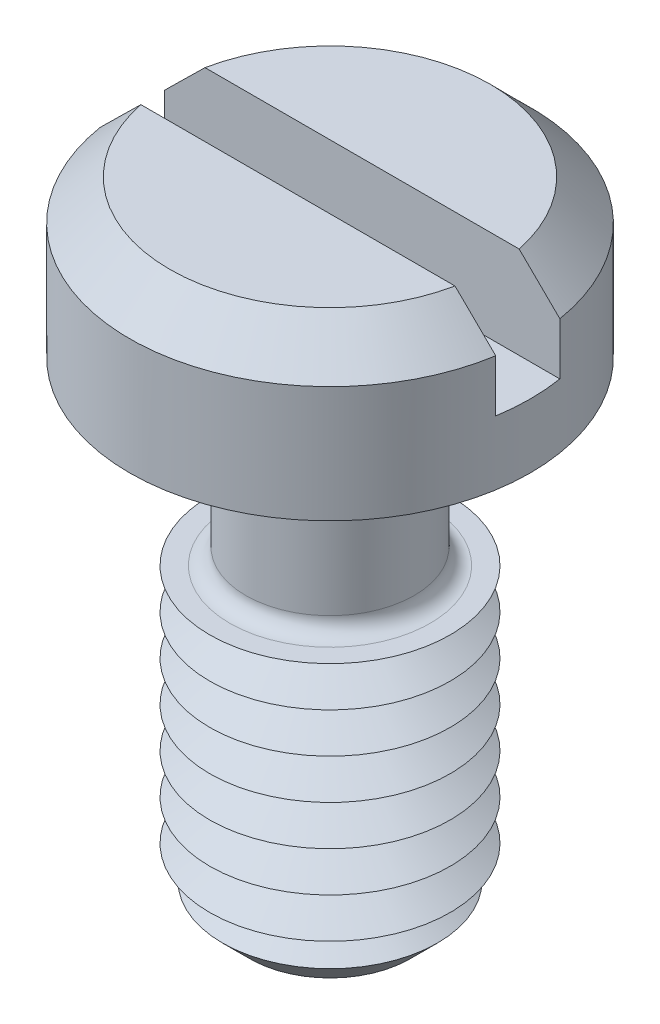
from build123d import *

# Parameters (mm, degrees)
SKETCH1_R           = 5
BOSS_EXTRUDE1_DEPTH = 3.9
SKETCH2_R           = 2.1
BOSS_EXTRUDE2_DEPTH = 12
SKETCH3_R           = 3
BOSS_EXTRUDE3_DEPTH = 7.5
CHAMFER1_SIZE       = 1
LPATTERN1_COUNT     = 7
LPATTERN1_PITCH     = 1
FILLET1_R           = 0.4
CHAMFER2_SIZE       = 1
SKETCH6_W           = 10
SKETCH6_H           = 1.6
CUT_EXTRUDE1_DEPTH  = 2.3


with BuildPart() as part:
    # Sketch1 → Boss-Extrude1 (new body)
    with BuildSketch(Plane(origin=(0, 0, 0), x_dir=(1, 0, 0), z_dir=(0, 1, 0))):
        with Locations(Location((0, 0, 0), (0, 0, 270))):
            Circle(SKETCH1_R)
    extrude(amount=BOSS_EXTRUDE1_DEPTH)

    # Sketch2 → Boss-Extrude2 (add)
    with BuildSketch(Plane.XZ):
        with Locations(Location((0, 0, 0), (0, 0, 270))):
            Circle(SKETCH2_R)
    extrude(amount=BOSS_EXTRUDE2_DEPTH)

    # Sketch3 → Boss-Extrude3 (add)
    with BuildSketch(Plane.XZ.offset(12)):
        with Locations(Location((0, 0, 0), (0, 0, 270))):
            Circle(SKETCH3_R)
    extrude(amount=-BOSS_EXTRUDE3_DEPTH)

    # Chamfer1
    chamfer1_edges = [part.edges().sort_by_distance(p)[0] for p in [
        (0, -12, 3),
    ]]
    chamfer(chamfer1_edges, length=CHAMFER1_SIZE)

    # Sketch5 → Cut-Revolve1 (revolve, cut)
    with BuildSketch(Plane(origin=(0, 0, 0), x_dir=(0, 0, -1), z_dir=(1, 0, 0))):
        Polygon((-3, -4.5), (-2.133974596, -5), (-3, -5.5), align=None)
    cut_revolve1 = revolve(axis=Axis((0, -6.58711856, 0), (0, -1, 0)), mode=Mode.SUBTRACT)

    # LPattern1: Cut-Revolve1 ×7
    with Locations(*[(0, -i * LPATTERN1_PITCH, 0) for i in range(1, LPATTERN1_COUNT)]):
        add(cut_revolve1, mode=Mode.SUBTRACT)

    # Fillet1
    fillet1_edges = [part.edges().sort_by_distance(p)[0] for p in [
        (0, 0, 2.1),
        (0, -4.5, 2.1),
    ]]
    fillet(fillet1_edges, radius=FILLET1_R)

    # Chamfer2
    chamfer2_edges = [part.edges().sort_by_distance(p)[0] for p in [
        (0, 3.9, -5),
    ]]
    chamfer(chamfer2_edges, length=CHAMFER2_SIZE)

    # Sketch6 → Cut-Extrude1 (cut)
    with BuildSketch(Plane(origin=(0, 3.9, 0), x_dir=(1, 0, 0), z_dir=(0, 1, 0))):
        Rectangle(SKETCH6_W, SKETCH6_H)
    extrude(amount=-CUT_EXTRUDE1_DEPTH, mode=Mode.SUBTRACT)


solid = part.part
